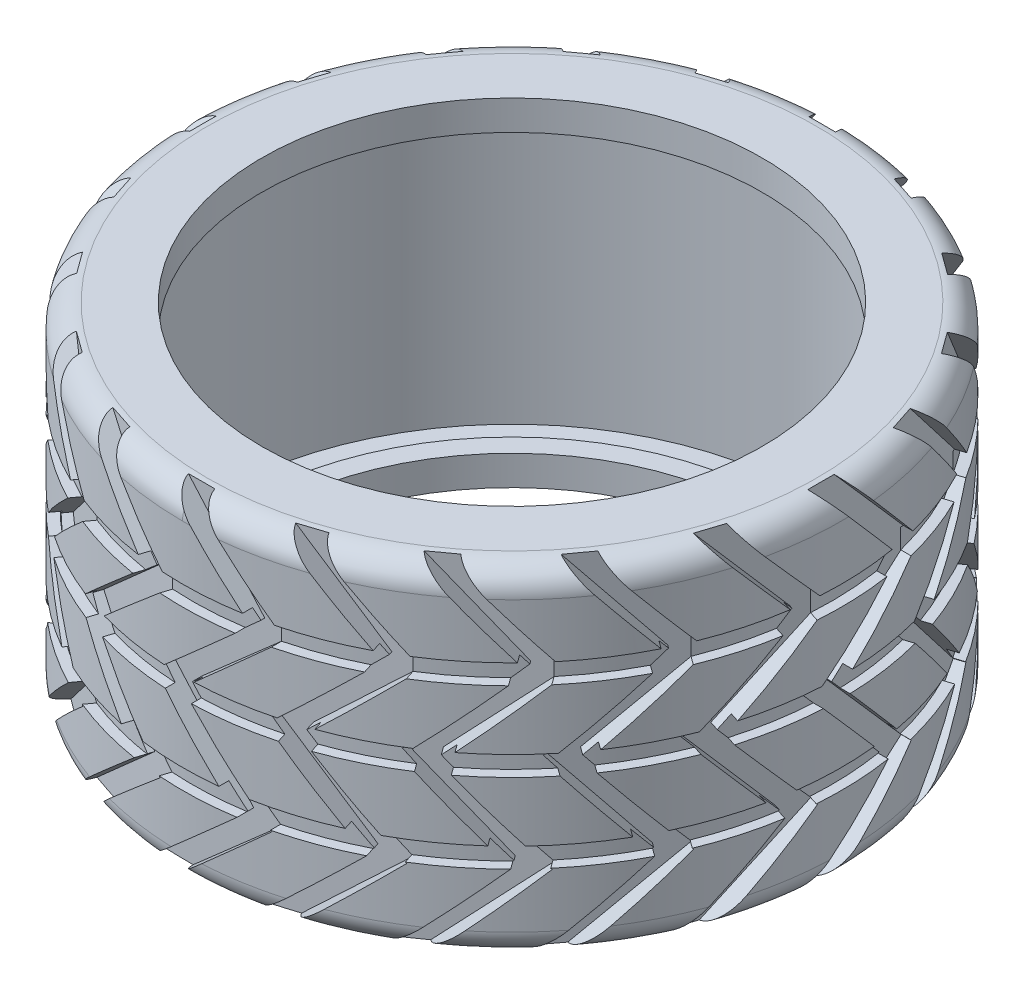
from build123d import *

# Parameters (mm, degrees)
SKETCH2_W          = 3.542238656
SKETCH2_H          = 2
CUT_EXTRUDE1_DEPTH = 2
CIRPATTERN1_COUNT  = 20


with BuildPart() as part:
    # Sketch1 → Revolve1 (revolve)
    with BuildSketch(Plane.XY, mode=Mode.PRIVATE) as revolve1_sk:
        with BuildLine():
            Line((30.7, -17), (25.2, -17))
            Line((25.2, -17), (25.2, -14))
            Line((25.2, -14), (27.2, -14))
            Line((27.2, -14), (27.2, -15))
            Line((27.2, -15), (30.2, -15))
            Line((30.2, -15), (30.2, 15))
            Line((30.2, 15), (27.2, 15))
            Line((27.2, 15), (27.2, 14))
            Line((27.2, 14), (25.2, 14))
            Line((25.2, 14), (25.2, 17))
            Line((25.2, 17), (30.7, 17))
            ThreePointArc((30.7, 17), (32.467766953, 16.267766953), (33.2, 14.5))
            Line((33.2, 14.5), (33.2, -14.5))
            ThreePointArc((33.2, -14.5), (32.467766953, -16.267766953), (30.7, -17))
        make_face()
    revolve(revolve1_sk.sketch.rotate(Axis((0, 83.637931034, 0), (0, -1, 0)), 90), axis=Axis((0, 83.637931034, 0), (0, -1, 0)))

    # Sketch2 → Cut-Revolve1 (revolve, cut)
    with BuildSketch(Plane.XY, mode=Mode.PRIVATE) as cut_revolve1_sk:
        with Locations((33.971119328, 8)):
            Rectangle(SKETCH2_W, SKETCH2_H)
        with Locations((33.971119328, 0)):
            Rectangle(SKETCH2_W, SKETCH2_H)
        with Locations((33.971119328, -8)):
            Rectangle(SKETCH2_W, SKETCH2_H)
    revolve(cut_revolve1_sk.sketch.rotate(Axis((0, 29.828243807, 0), (0, -1, 0)), 90), axis=Axis((0, 29.828243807, 0), (0, -1, 0)), mode=Mode.SUBTRACT)

    # Sketch3 → Cut-Extrude1 (cut)
    with BuildSketch(Plane(origin=(33.2, 0, 0), x_dir=(0, 0, -1), z_dir=(1, 0, 0))):
        Polygon((0, 0), (9.113313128, 8), (1.113313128, 17.113313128), (-1.547962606, 17.113313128), (-0.247933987, 15.632367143), (6.29085231, 8.183616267), (-2.822460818, 0.183616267), (5.177539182, -8.92969686), (-2.432735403, -15.610274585), (-4.144943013, -17.113313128), (-1.113313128, -17.113313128), (8, -9.113313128), align=None)
    cut_extrude1 = extrude(amount=-CUT_EXTRUDE1_DEPTH, mode=Mode.SUBTRACT)

    # CirPattern1: Cut-Extrude1 ×20 about axis
    cirpattern1_axis = Axis((0, 0, 0), (0, 1, 0))
    for i in range(1, CIRPATTERN1_COUNT):
        add(cut_extrude1.rotate(cirpattern1_axis, i * 360 / CIRPATTERN1_COUNT), mode=Mode.SUBTRACT)


solid = part.part
